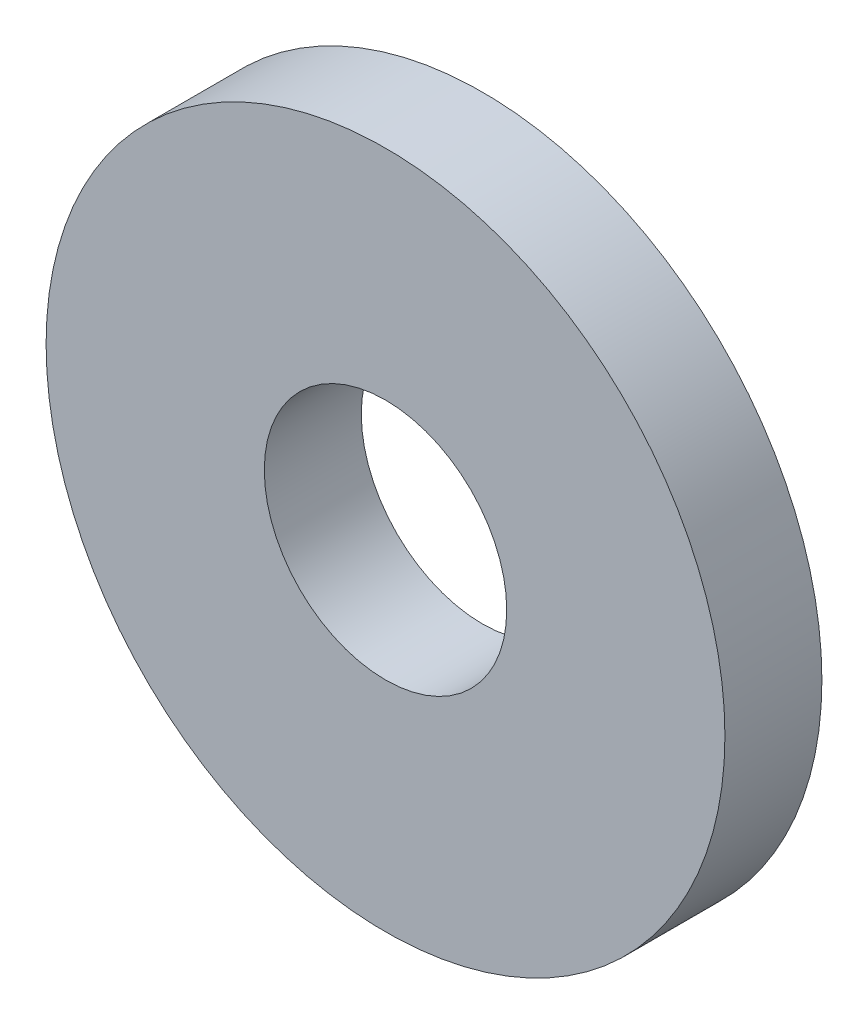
ISO-10303-21;
HEADER;
FILE_DESCRIPTION(('STEP AP214'),'2;1');
FILE_NAME('part.step','',(''),(''),'','','');
FILE_SCHEMA(('AUTOMOTIVE_DESIGN { 1 0 10303 214 1 1 1 1 }'));
ENDSEC;
DATA;
#1=APPLICATION_CONTEXT('core data for automotive mechanical design processes');
#2=APPLICATION_PROTOCOL_DEFINITION('international standard','automotive_design',2000,#1);
#3=PRODUCT_CONTEXT('',#1,'mechanical');
#4=PRODUCT('Part','Part','',(#3));
#5=PRODUCT_RELATED_PRODUCT_CATEGORY('part','',(#4));
#6=PRODUCT_DEFINITION_FORMATION('','',#4);
#7=PRODUCT_DEFINITION_CONTEXT('part definition',#1,'design');
#8=PRODUCT_DEFINITION('design','',#6,#7);
#9=PRODUCT_DEFINITION_SHAPE('','',#8);
#10=(LENGTH_UNIT() NAMED_UNIT(*) SI_UNIT(.MILLI.,.METRE.));
#11=(NAMED_UNIT(*) PLANE_ANGLE_UNIT() SI_UNIT($,.RADIAN.));
#12=(NAMED_UNIT(*) SI_UNIT($,.STERADIAN.) SOLID_ANGLE_UNIT());
#13=UNCERTAINTY_MEASURE_WITH_UNIT(LENGTH_MEASURE(1.E-05),#10,'distance_accuracy_value','');
#14=(GEOMETRIC_REPRESENTATION_CONTEXT(3) GLOBAL_UNCERTAINTY_ASSIGNED_CONTEXT((#13)) GLOBAL_UNIT_ASSIGNED_CONTEXT((#10,
#11,#12)) REPRESENTATION_CONTEXT('',''));
#15=CARTESIAN_POINT('',(0.,0.,0.));
#16=DIRECTION('',(0.,0.,1.));
#17=DIRECTION('',(1.,0.,0.));
#18=AXIS2_PLACEMENT_3D('',#15,#16,#17);
#19=CARTESIAN_POINT('',(0.,0.,4.));
#20=DIRECTION('',(0.,0.,1.));
#21=DIRECTION('',(1.,0.,0.));
#22=AXIS2_PLACEMENT_3D('',#19,#20,#21);
#23=PLANE('',#22);
#24=CARTESIAN_POINT('',(0.,0.,4.));
#25=DIRECTION('',(0.,0.,1.));
#26=DIRECTION('',(1.,0.,0.));
#27=AXIS2_PLACEMENT_3D('',#24,#25,#26);
#28=CIRCLE('',#27,14.);
#29=CARTESIAN_POINT('',(14.,0.,4.));
#30=VERTEX_POINT('',#29);
#31=EDGE_CURVE('E10',#30,#30,#28,.T.);
#32=ORIENTED_EDGE('',*,*,#31,.T.);
#33=EDGE_LOOP('',(#32));
#34=FACE_BOUND('',#33,.T.);
#35=CARTESIAN_POINT('',(0.,0.,4.));
#36=DIRECTION('',(0.,0.,1.));
#37=DIRECTION('',(1.,0.,0.));
#38=AXIS2_PLACEMENT_3D('',#35,#36,#37);
#39=CIRCLE('',#38,5.);
#40=CARTESIAN_POINT('',(5.,0.,4.));
#41=VERTEX_POINT('',#40);
#42=EDGE_CURVE('E54',#41,#41,#39,.T.);
#43=ORIENTED_EDGE('',*,*,#42,.F.);
#44=EDGE_LOOP('',(#43));
#45=FACE_BOUND('',#44,.T.);
#46=ADVANCED_FACE('F41',(#34,#45),#23,.T.);
#47=CARTESIAN_POINT('',(0.,0.,0.));
#48=DIRECTION('',(0.,0.,1.));
#49=DIRECTION('',(1.,0.,0.));
#50=AXIS2_PLACEMENT_3D('',#47,#48,#49);
#51=PLANE('',#50);
#52=CARTESIAN_POINT('',(0.,0.,0.));
#53=DIRECTION('',(0.,0.,1.));
#54=DIRECTION('',(1.,0.,0.));
#55=AXIS2_PLACEMENT_3D('',#52,#53,#54);
#56=CIRCLE('',#55,14.);
#57=CARTESIAN_POINT('',(14.,0.,0.));
#58=VERTEX_POINT('',#57);
#59=EDGE_CURVE('E45',#58,#58,#56,.T.);
#60=ORIENTED_EDGE('',*,*,#59,.F.);
#61=EDGE_LOOP('',(#60));
#62=FACE_BOUND('',#61,.T.);
#63=CARTESIAN_POINT('',(0.,0.,0.));
#64=DIRECTION('',(0.,0.,1.));
#65=DIRECTION('',(1.,0.,0.));
#66=AXIS2_PLACEMENT_3D('',#63,#64,#65);
#67=CIRCLE('',#66,5.);
#68=CARTESIAN_POINT('',(5.,0.,0.));
#69=VERTEX_POINT('',#68);
#70=EDGE_CURVE('E56',#69,#69,#67,.T.);
#71=ORIENTED_EDGE('',*,*,#70,.T.);
#72=EDGE_LOOP('',(#71));
#73=FACE_BOUND('',#72,.T.);
#74=ADVANCED_FACE('F68',(#62,#73),#51,.F.);
#75=CARTESIAN_POINT('',(0.,0.,4.));
#76=DIRECTION('',(0.,0.,-1.));
#77=DIRECTION('',(-1.,0.,0.));
#78=AXIS2_PLACEMENT_3D('',#75,#76,#77);
#79=CYLINDRICAL_SURFACE('',#78,14.);
#80=ORIENTED_EDGE('',*,*,#31,.F.);
#81=EDGE_LOOP('',(#80));
#82=FACE_BOUND('',#81,.T.);
#83=ORIENTED_EDGE('',*,*,#59,.T.);
#84=EDGE_LOOP('',(#83));
#85=FACE_BOUND('',#84,.T.);
#86=ADVANCED_FACE('F43',(#82,#85),#79,.T.);
#87=CARTESIAN_POINT('',(0.,0.,4.));
#88=DIRECTION('',(0.,0.,-1.));
#89=DIRECTION('',(-1.,0.,0.));
#90=AXIS2_PLACEMENT_3D('',#87,#88,#89);
#91=CYLINDRICAL_SURFACE('',#90,5.);
#92=ORIENTED_EDGE('',*,*,#42,.T.);
#93=EDGE_LOOP('',(#92));
#94=FACE_BOUND('',#93,.T.);
#95=ORIENTED_EDGE('',*,*,#70,.F.);
#96=EDGE_LOOP('',(#95));
#97=FACE_BOUND('',#96,.T.);
#98=ADVANCED_FACE('F64',(#94,#97),#91,.F.);
#99=CLOSED_SHELL('',(#46,#74,#86,#98));
#100=MANIFOLD_SOLID_BREP('B2',#99);
#101=ADVANCED_BREP_SHAPE_REPRESENTATION('',(#18,#100),#14);
#102=SHAPE_DEFINITION_REPRESENTATION(#9,#101);
ENDSEC;
END-ISO-10303-21;
